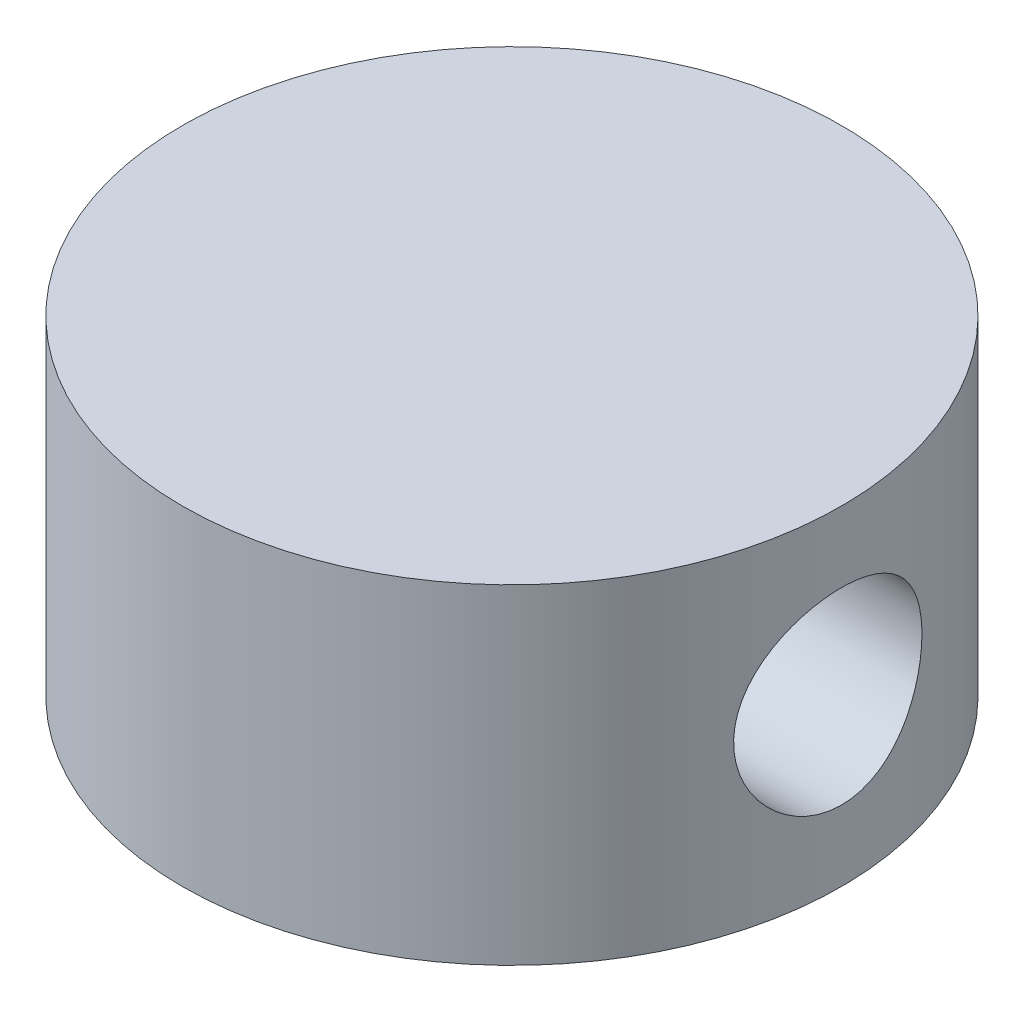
ISO-10303-21;
HEADER;
FILE_DESCRIPTION(('STEP AP214'),'2;1');
FILE_NAME('part.step','',(''),(''),'','','');
FILE_SCHEMA(('AUTOMOTIVE_DESIGN { 1 0 10303 214 1 1 1 1 }'));
ENDSEC;
DATA;
#1=APPLICATION_CONTEXT('core data for automotive mechanical design processes');
#2=APPLICATION_PROTOCOL_DEFINITION('international standard','automotive_design',2000,#1);
#3=PRODUCT_CONTEXT('',#1,'mechanical');
#4=PRODUCT('Part','Part','',(#3));
#5=PRODUCT_RELATED_PRODUCT_CATEGORY('part','',(#4));
#6=PRODUCT_DEFINITION_FORMATION('','',#4);
#7=PRODUCT_DEFINITION_CONTEXT('part definition',#1,'design');
#8=PRODUCT_DEFINITION('design','',#6,#7);
#9=PRODUCT_DEFINITION_SHAPE('','',#8);
#10=(LENGTH_UNIT() NAMED_UNIT(*) SI_UNIT(.MILLI.,.METRE.));
#11=(NAMED_UNIT(*) PLANE_ANGLE_UNIT() SI_UNIT($,.RADIAN.));
#12=(NAMED_UNIT(*) SI_UNIT($,.STERADIAN.) SOLID_ANGLE_UNIT());
#13=UNCERTAINTY_MEASURE_WITH_UNIT(LENGTH_MEASURE(1.E-05),#10,'distance_accuracy_value','');
#14=(GEOMETRIC_REPRESENTATION_CONTEXT(3) GLOBAL_UNCERTAINTY_ASSIGNED_CONTEXT((#13)) GLOBAL_UNIT_ASSIGNED_CONTEXT((#10,
#11,#12)) REPRESENTATION_CONTEXT('',''));
#15=CARTESIAN_POINT('',(0.,0.,0.));
#16=DIRECTION('',(0.,0.,1.));
#17=DIRECTION('',(1.,0.,0.));
#18=AXIS2_PLACEMENT_3D('',#15,#16,#17);
#19=CARTESIAN_POINT('',(0.,7.,0.));
#20=DIRECTION('',(0.,-1.,0.));
#21=DIRECTION('',(0.,0.,-1.));
#22=AXIS2_PLACEMENT_3D('',#19,#20,#21);
#23=CYLINDRICAL_SURFACE('',#22,7.);
#24=CARTESIAN_POINT('',(6.70820393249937,3.5,-2.));
#25=CARTESIAN_POINT('',(6.70820547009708,3.39014846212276,-1.99999802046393));
#26=CARTESIAN_POINT('',(6.71093179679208,3.28027691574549,-1.9909186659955));
#27=CARTESIAN_POINT('',(6.72150389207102,3.06372876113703,-1.95492363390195));
#28=CARTESIAN_POINT('',(6.72935174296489,2.95705347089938,-1.92800070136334));
#29=CARTESIAN_POINT('',(6.74920709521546,2.7500627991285,-1.85729343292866));
#30=CARTESIAN_POINT('',(6.76120815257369,2.64973784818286,-1.81353520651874));
#31=CARTESIAN_POINT('',(6.78800921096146,2.45783218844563,-1.71048364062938));
#32=CARTESIAN_POINT('',(6.80280954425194,2.36625251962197,-1.65118845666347));
#33=CARTESIAN_POINT('',(6.83401783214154,2.19180843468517,-1.51692480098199));
#34=CARTESIAN_POINT('',(6.8504575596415,2.10923219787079,-1.4415892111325));
#35=CARTESIAN_POINT('',(6.88281965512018,1.95769721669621,-1.27817124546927));
#36=CARTESIAN_POINT('',(6.89874196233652,1.88874006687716,-1.19008737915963));
#37=CARTESIAN_POINT('',(6.92863332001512,1.76517135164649,-1.00164603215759));
#38=CARTESIAN_POINT('',(6.94256054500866,1.71085038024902,-0.901090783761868));
#39=CARTESIAN_POINT('',(6.96652540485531,1.61999822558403,-0.69180847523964));
#40=CARTESIAN_POINT('',(6.97656379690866,1.58346357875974,-0.583083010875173));
#41=CARTESIAN_POINT('',(6.99139519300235,1.53016553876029,-0.363558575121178));
#42=CARTESIAN_POINT('',(6.99631827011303,1.51291097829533,-0.25288779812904));
#43=CARTESIAN_POINT('',(7.00082095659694,1.49711326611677,-0.0301201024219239));
#44=CARTESIAN_POINT('',(7.00040158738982,1.49856653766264,0.0819765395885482));
#45=CARTESIAN_POINT('',(6.99436006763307,1.51980637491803,0.30098019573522));
#46=CARTESIAN_POINT('',(6.98888870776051,1.53906161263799,0.407943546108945));
#47=CARTESIAN_POINT('',(6.97353886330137,1.59449510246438,0.617052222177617));
#48=CARTESIAN_POINT('',(6.96366011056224,1.63067438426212,0.719197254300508));
#49=CARTESIAN_POINT('',(6.94039031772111,1.71930940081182,0.917073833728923));
#50=CARTESIAN_POINT('',(6.92696205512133,1.77193877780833,1.01272304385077));
#51=CARTESIAN_POINT('',(6.89802768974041,1.89184458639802,1.19400724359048));
#52=CARTESIAN_POINT('',(6.8825211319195,1.95912422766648,1.27964003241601));
#53=CARTESIAN_POINT('',(6.85045683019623,2.10920571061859,1.44163264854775));
#54=CARTESIAN_POINT('',(6.83388129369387,2.19246943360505,1.51756157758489));
#55=CARTESIAN_POINT('',(6.80202973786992,2.37071509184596,1.65449301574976));
#56=CARTESIAN_POINT('',(6.78675382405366,2.465697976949,1.71549431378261));
#57=CARTESIAN_POINT('',(6.75915174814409,2.66573088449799,1.82123335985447));
#58=CARTESIAN_POINT('',(6.74685010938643,2.77085522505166,1.86583737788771));
#59=CARTESIAN_POINT('',(6.72688544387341,2.98755316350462,1.9365895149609));
#60=CARTESIAN_POINT('',(6.71922106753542,3.09912487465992,1.9627430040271));
#61=CARTESIAN_POINT('',(6.70969115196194,3.32148042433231,1.99507417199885));
#62=CARTESIAN_POINT('',(6.70763711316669,3.43216181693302,2.00190148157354));
#63=CARTESIAN_POINT('',(6.7090415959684,3.65308831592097,1.99718996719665));
#64=CARTESIAN_POINT('',(6.71249942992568,3.76333347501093,1.98565343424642));
#65=CARTESIAN_POINT('',(6.72435430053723,3.97764122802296,1.94511781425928));
#66=CARTESIAN_POINT('',(6.73263642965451,4.08178758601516,1.9165246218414));
#67=CARTESIAN_POINT('',(6.75309063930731,4.28380187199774,1.84315161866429));
#68=CARTESIAN_POINT('',(6.7652632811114,4.38166889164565,1.79836947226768));
#69=CARTESIAN_POINT('',(6.7925018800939,4.57102207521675,1.69261965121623));
#70=CARTESIAN_POINT('',(6.80763197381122,4.6622904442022,1.63127891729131));
#71=CARTESIAN_POINT('',(6.83893726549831,4.83347637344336,1.49460463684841));
#72=CARTESIAN_POINT('',(6.85511268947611,4.91339146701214,1.41926805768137));
#73=CARTESIAN_POINT('',(6.88734727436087,5.06237941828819,1.25370800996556));
#74=CARTESIAN_POINT('',(6.90338406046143,5.13099497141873,1.16306771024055));
#75=CARTESIAN_POINT('',(6.93297977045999,5.25204568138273,0.971185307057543));
#76=CARTESIAN_POINT('',(6.94653882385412,5.30448168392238,0.869943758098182));
#77=CARTESIAN_POINT('',(6.96956504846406,5.39118428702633,0.660433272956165));
#78=CARTESIAN_POINT('',(6.97906308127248,5.42558838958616,0.552224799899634));
#79=CARTESIAN_POINT('',(6.99303339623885,5.47562680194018,0.331245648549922));
#80=CARTESIAN_POINT('',(6.99750697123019,5.49126594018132,0.218476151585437));
#81=CARTESIAN_POINT('',(7.00085335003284,5.50299143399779,-0.00417823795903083));
#82=CARTESIAN_POINT('',(6.99991703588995,5.49974414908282,-0.114025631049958));
#83=CARTESIAN_POINT('',(6.99299069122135,5.47536171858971,-0.331545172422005));
#84=CARTESIAN_POINT('',(6.98700090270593,5.45422742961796,-0.439217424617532));
#85=CARTESIAN_POINT('',(6.97068801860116,5.39506863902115,-0.648404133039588));
#86=CARTESIAN_POINT('',(6.96040414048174,5.35719682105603,-0.749965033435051));
#87=CARTESIAN_POINT('',(6.93657094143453,5.26577384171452,-0.945347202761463));
#88=CARTESIAN_POINT('',(6.92302111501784,5.21222025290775,-1.03916727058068));
#89=CARTESIAN_POINT('',(6.89358955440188,5.08910266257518,-1.21943345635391));
#90=CARTESIAN_POINT('',(6.8776504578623,5.01910991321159,-1.30557732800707));
#91=CARTESIAN_POINT('',(6.84544064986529,4.86589087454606,-1.46512122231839));
#92=CARTESIAN_POINT('',(6.82916984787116,4.78266092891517,-1.53851771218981));
#93=CARTESIAN_POINT('',(6.79764037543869,4.60270308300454,-1.67240846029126));
#94=CARTESIAN_POINT('',(6.78241951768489,4.50567805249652,-1.73251316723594));
#95=CARTESIAN_POINT('',(6.7552844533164,4.30247813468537,-1.83547943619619));
#96=CARTESIAN_POINT('',(6.74336839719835,4.19630840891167,-1.8783506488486));
#97=CARTESIAN_POINT('',(6.72558459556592,3.99234629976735,-1.94098534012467));
#98=CARTESIAN_POINT('',(6.71912438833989,3.89530965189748,-1.96305899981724));
#99=CARTESIAN_POINT('',(6.71043369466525,3.69885388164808,-1.99256607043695));
#100=CARTESIAN_POINT('',(6.70820254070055,3.5994351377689,-2.00000179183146));
#101=CARTESIAN_POINT('',(6.70820393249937,3.5,-2.));
#102=B_SPLINE_CURVE_WITH_KNOTS('',3,(#24,#25,#26,#27,#28,#29,#30,#31,#32,#33,#34,#35,#36,#37,
#38,#39,#40,#41,#42,#43,#44,#45,#46,#47,#48,#49,#50,#51,#52,#53,#54,#55,#56,#57,#58,#59,#60,#61,
#62,#63,#64,#65,#66,#67,#68,#69,#70,#71,#72,#73,#74,#75,#76,#77,#78,#79,#80,#81,#82,#83,#84,#85,
#86,#87,#88,#89,#90,#91,#92,#93,#94,#95,#96,#97,#98,#99,#100,#101),.UNSPECIFIED.,.T.,.F.,(4,2,2,
2,2,2,2,2,2,2,2,2,2,2,2,2,2,2,2,2,2,2,2,2,2,2,2,2,2,2,2,2,2,2,2,2,2,2,4),(0.,0.32918834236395,
0.658510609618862,0.987324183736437,1.31617681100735,1.65357167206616,1.99100601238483,
2.33471483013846,2.67835669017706,3.01302901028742,3.34763734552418,3.67257037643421,
3.99752317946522,4.32602903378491,4.65460693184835,4.99471612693,5.3348529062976,
5.67770520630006,6.02045767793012,6.35154363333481,6.68258828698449,7.00605289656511,
7.32956419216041,7.66108006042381,7.99266784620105,8.33545388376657,8.67822200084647,
9.01833685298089,9.35836417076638,9.6864689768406,10.0145580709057,10.3397141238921,
10.6649205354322,10.9997976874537,11.3347674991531,11.6785361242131,12.0221119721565,
12.3201328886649,12.61810676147),.UNSPECIFIED.);
#103=CARTESIAN_POINT('',(6.70820393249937,3.5,-2.));
#104=VERTEX_POINT('',#103);
#105=EDGE_CURVE('E10',#104,#104,#102,.T.);
#106=ORIENTED_EDGE('',*,*,#105,.T.);
#107=EDGE_LOOP('',(#106));
#108=FACE_BOUND('',#107,.T.);
#109=CARTESIAN_POINT('',(0.,7.,0.));
#110=DIRECTION('',(0.,1.,0.));
#111=DIRECTION('',(0.,0.,1.));
#112=AXIS2_PLACEMENT_3D('',#109,#110,#111);
#113=CIRCLE('',#112,7.);
#114=CARTESIAN_POINT('',(0.,7.,7.));
#115=VERTEX_POINT('',#114);
#116=EDGE_CURVE('E39',#115,#115,#113,.T.);
#117=ORIENTED_EDGE('',*,*,#116,.F.);
#118=EDGE_LOOP('',(#117));
#119=FACE_BOUND('',#118,.T.);
#120=CARTESIAN_POINT('',(0.,0.,0.));
#121=DIRECTION('',(0.,1.,0.));
#122=DIRECTION('',(0.,0.,1.));
#123=AXIS2_PLACEMENT_3D('',#120,#121,#122);
#124=CIRCLE('',#123,7.);
#125=CARTESIAN_POINT('',(0.,0.,7.));
#126=VERTEX_POINT('',#125);
#127=EDGE_CURVE('E43',#126,#126,#124,.T.);
#128=ORIENTED_EDGE('',*,*,#127,.T.);
#129=EDGE_LOOP('',(#128));
#130=FACE_BOUND('',#129,.T.);
#131=ADVANCED_FACE('F29',(#108,#119,#130),#23,.T.);
#132=CARTESIAN_POINT('',(0.,7.,0.));
#133=DIRECTION('',(0.,1.,0.));
#134=DIRECTION('',(0.,0.,1.));
#135=AXIS2_PLACEMENT_3D('',#132,#133,#134);
#136=PLANE('',#135);
#137=ORIENTED_EDGE('',*,*,#116,.T.);
#138=EDGE_LOOP('',(#137));
#139=FACE_BOUND('',#138,.T.);
#140=ADVANCED_FACE('F64',(#139),#136,.T.);
#141=CARTESIAN_POINT('',(0.,0.,0.));
#142=DIRECTION('',(0.,1.,0.));
#143=DIRECTION('',(0.,0.,1.));
#144=AXIS2_PLACEMENT_3D('',#141,#142,#143);
#145=PLANE('',#144);
#146=ORIENTED_EDGE('',*,*,#127,.F.);
#147=EDGE_LOOP('',(#146));
#148=FACE_BOUND('',#147,.T.);
#149=ADVANCED_FACE('F58',(#148),#145,.F.);
#150=CARTESIAN_POINT('',(-4.,3.5,0.));
#151=DIRECTION('',(1.,0.,0.));
#152=DIRECTION('',(0.,0.,-1.));
#153=AXIS2_PLACEMENT_3D('',#150,#151,#152);
#154=CYLINDRICAL_SURFACE('',#153,2.);
#155=CARTESIAN_POINT('',(-4.,3.5,0.));
#156=DIRECTION('',(1.,0.,0.));
#157=DIRECTION('',(0.,0.,-1.));
#158=AXIS2_PLACEMENT_3D('',#155,#156,#157);
#159=CIRCLE('',#158,2.);
#160=CARTESIAN_POINT('',(-4.,3.5,-2.));
#161=VERTEX_POINT('',#160);
#162=EDGE_CURVE('E48',#161,#161,#159,.T.);
#163=ORIENTED_EDGE('',*,*,#162,.F.);
#164=EDGE_LOOP('',(#163));
#165=FACE_BOUND('',#164,.T.);
#166=ORIENTED_EDGE('',*,*,#105,.F.);
#167=EDGE_LOOP('',(#166));
#168=FACE_BOUND('',#167,.T.);
#169=ADVANCED_FACE('F55',(#165,#168),#154,.F.);
#170=CARTESIAN_POINT('',(-4.,7.,-11.0308657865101));
#171=DIRECTION('',(1.,0.,0.));
#172=DIRECTION('',(0.,0.,-1.));
#173=AXIS2_PLACEMENT_3D('',#170,#171,#172);
#174=PLANE('',#173);
#175=ORIENTED_EDGE('',*,*,#162,.T.);
#176=EDGE_LOOP('',(#175));
#177=FACE_BOUND('',#176,.T.);
#178=ADVANCED_FACE('F53',(#177),#174,.T.);
#179=CLOSED_SHELL('',(#131,#140,#149,#169,#178));
#180=MANIFOLD_SOLID_BREP('B2',#179);
#181=ADVANCED_BREP_SHAPE_REPRESENTATION('',(#18,#180),#14);
#182=SHAPE_DEFINITION_REPRESENTATION(#9,#181);
ENDSEC;
END-ISO-10303-21;
